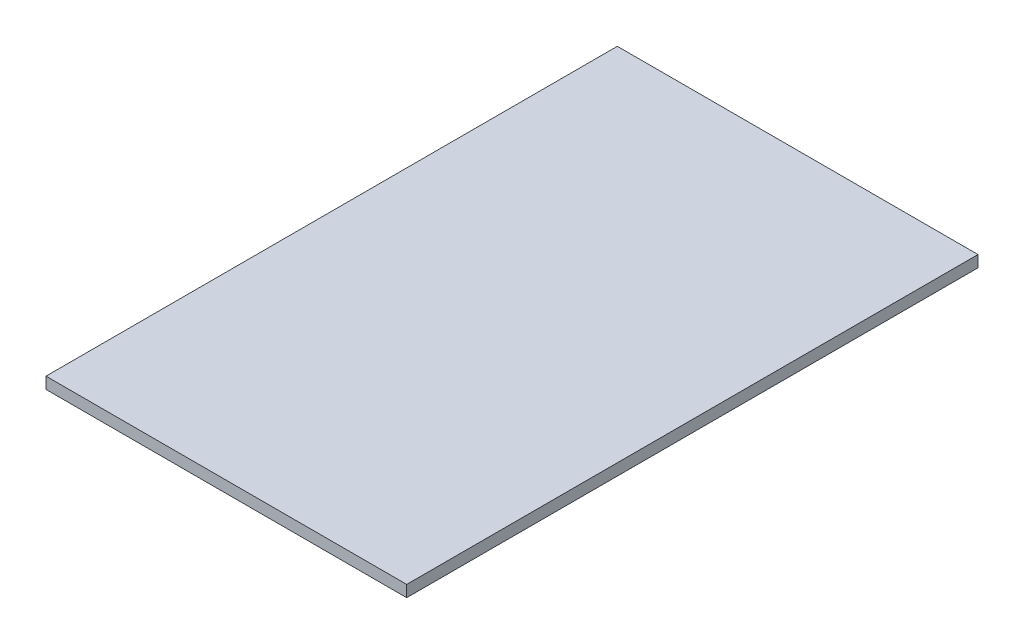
ISO-10303-21;
HEADER;
FILE_DESCRIPTION(('STEP AP214'),'2;1');
FILE_NAME('part.step','',(''),(''),'','','');
FILE_SCHEMA(('AUTOMOTIVE_DESIGN { 1 0 10303 214 1 1 1 1 }'));
ENDSEC;
DATA;
#1=APPLICATION_CONTEXT('core data for automotive mechanical design processes');
#2=APPLICATION_PROTOCOL_DEFINITION('international standard','automotive_design',2000,#1);
#3=PRODUCT_CONTEXT('',#1,'mechanical');
#4=PRODUCT('Part','Part','',(#3));
#5=PRODUCT_RELATED_PRODUCT_CATEGORY('part','',(#4));
#6=PRODUCT_DEFINITION_FORMATION('','',#4);
#7=PRODUCT_DEFINITION_CONTEXT('part definition',#1,'design');
#8=PRODUCT_DEFINITION('design','',#6,#7);
#9=PRODUCT_DEFINITION_SHAPE('','',#8);
#10=(LENGTH_UNIT() NAMED_UNIT(*) SI_UNIT(.MILLI.,.METRE.));
#11=(NAMED_UNIT(*) PLANE_ANGLE_UNIT() SI_UNIT($,.RADIAN.));
#12=(NAMED_UNIT(*) SI_UNIT($,.STERADIAN.) SOLID_ANGLE_UNIT());
#13=UNCERTAINTY_MEASURE_WITH_UNIT(LENGTH_MEASURE(1.E-05),#10,'distance_accuracy_value','');
#14=(GEOMETRIC_REPRESENTATION_CONTEXT(3) GLOBAL_UNCERTAINTY_ASSIGNED_CONTEXT((#13)) GLOBAL_UNIT_ASSIGNED_CONTEXT((#10,
#11,#12)) REPRESENTATION_CONTEXT('',''));
#15=CARTESIAN_POINT('',(0.,0.,0.));
#16=DIRECTION('',(0.,0.,1.));
#17=DIRECTION('',(1.,0.,0.));
#18=AXIS2_PLACEMENT_3D('',#15,#16,#17);
#19=CARTESIAN_POINT('',(250.,8.,0.));
#20=DIRECTION('',(0.,1.,0.));
#21=DIRECTION('',(0.,0.,1.));
#22=AXIS2_PLACEMENT_3D('',#19,#20,#21);
#23=PLANE('',#22);
#24=DIRECTION('',(0.,0.,1.));
#25=VECTOR('',#24,1.);
#26=CARTESIAN_POINT('',(0.,8.,0.));
#27=LINE('',#26,#25);
#28=CARTESIAN_POINT('',(0.,8.,396.));
#29=VERTEX_POINT('',#28);
#30=CARTESIAN_POINT('',(0.,8.,0.));
#31=VERTEX_POINT('',#30);
#32=EDGE_CURVE('E20',#29,#31,#27,.F.);
#33=ORIENTED_EDGE('',*,*,#32,.F.);
#34=DIRECTION('',(1.,0.,0.));
#35=VECTOR('',#34,1.);
#36=CARTESIAN_POINT('',(0.,8.,396.));
#37=LINE('',#36,#35);
#38=CARTESIAN_POINT('',(250.,8.,396.));
#39=VERTEX_POINT('',#38);
#40=EDGE_CURVE('E80',#39,#29,#37,.F.);
#41=ORIENTED_EDGE('',*,*,#40,.F.);
#42=DIRECTION('',(0.,0.,-1.));
#43=VECTOR('',#42,1.);
#44=CARTESIAN_POINT('',(250.,8.,0.));
#45=LINE('',#44,#43);
#46=CARTESIAN_POINT('',(250.,8.,0.));
#47=VERTEX_POINT('',#46);
#48=EDGE_CURVE('E61',#47,#39,#45,.F.);
#49=ORIENTED_EDGE('',*,*,#48,.F.);
#50=DIRECTION('',(1.,0.,0.));
#51=VECTOR('',#50,1.);
#52=CARTESIAN_POINT('',(0.,8.,0.));
#53=LINE('',#52,#51);
#54=EDGE_CURVE('E55',#47,#31,#53,.F.);
#55=ORIENTED_EDGE('',*,*,#54,.T.);
#56=EDGE_LOOP('',(#33,#41,#49,#55));
#57=FACE_BOUND('',#56,.T.);
#58=ADVANCED_FACE('F17',(#57),#23,.T.);
#59=CARTESIAN_POINT('',(0.,8.,0.));
#60=DIRECTION('',(-1.,0.,0.));
#61=DIRECTION('',(0.,0.,1.));
#62=AXIS2_PLACEMENT_3D('',#59,#60,#61);
#63=PLANE('',#62);
#64=DIRECTION('',(0.,0.,-1.));
#65=VECTOR('',#64,1.);
#66=CARTESIAN_POINT('',(0.,0.,0.));
#67=LINE('',#66,#65);
#68=CARTESIAN_POINT('',(0.,0.,396.));
#69=VERTEX_POINT('',#68);
#70=CARTESIAN_POINT('',(0.,0.,0.));
#71=VERTEX_POINT('',#70);
#72=EDGE_CURVE('E83',#69,#71,#67,.T.);
#73=ORIENTED_EDGE('',*,*,#72,.F.);
#74=DIRECTION('',(0.,1.,0.));
#75=VECTOR('',#74,1.);
#76=CARTESIAN_POINT('',(0.,0.,396.));
#77=LINE('',#76,#75);
#78=EDGE_CURVE('E68',#29,#69,#77,.F.);
#79=ORIENTED_EDGE('',*,*,#78,.F.);
#80=ORIENTED_EDGE('',*,*,#32,.T.);
#81=DIRECTION('',(0.,1.,0.));
#82=VECTOR('',#81,1.);
#83=CARTESIAN_POINT('',(0.,0.,0.));
#84=LINE('',#83,#82);
#85=EDGE_CURVE('E63',#31,#71,#84,.F.);
#86=ORIENTED_EDGE('',*,*,#85,.T.);
#87=EDGE_LOOP('',(#73,#79,#80,#86));
#88=FACE_BOUND('',#87,.T.);
#89=ADVANCED_FACE('F65',(#88),#63,.T.);
#90=CARTESIAN_POINT('',(0.,0.,0.));
#91=DIRECTION('',(0.,0.,1.));
#92=DIRECTION('',(1.,0.,0.));
#93=AXIS2_PLACEMENT_3D('',#90,#91,#92);
#94=PLANE('',#93);
#95=ORIENTED_EDGE('',*,*,#54,.F.);
#96=DIRECTION('',(0.,1.,0.));
#97=VECTOR('',#96,1.);
#98=CARTESIAN_POINT('',(250.,0.,0.));
#99=LINE('',#98,#97);
#100=CARTESIAN_POINT('',(250.,0.,0.));
#101=VERTEX_POINT('',#100);
#102=EDGE_CURVE('E74',#101,#47,#99,.T.);
#103=ORIENTED_EDGE('',*,*,#102,.F.);
#104=DIRECTION('',(1.,0.,0.));
#105=VECTOR('',#104,1.);
#106=CARTESIAN_POINT('',(0.,0.,0.));
#107=LINE('',#106,#105);
#108=EDGE_CURVE('E72',#71,#101,#107,.T.);
#109=ORIENTED_EDGE('',*,*,#108,.F.);
#110=ORIENTED_EDGE('',*,*,#85,.F.);
#111=EDGE_LOOP('',(#95,#103,#109,#110));
#112=FACE_BOUND('',#111,.T.);
#113=ADVANCED_FACE('F70',(#112),#94,.F.);
#114=CARTESIAN_POINT('',(250.,0.,0.));
#115=DIRECTION('',(1.,0.,0.));
#116=DIRECTION('',(0.,0.,-1.));
#117=AXIS2_PLACEMENT_3D('',#114,#115,#116);
#118=PLANE('',#117);
#119=ORIENTED_EDGE('',*,*,#48,.T.);
#120=DIRECTION('',(0.,1.,0.));
#121=VECTOR('',#120,1.);
#122=CARTESIAN_POINT('',(250.,0.,396.));
#123=LINE('',#122,#121);
#124=CARTESIAN_POINT('',(250.,0.,396.));
#125=VERTEX_POINT('',#124);
#126=EDGE_CURVE('E35',#125,#39,#123,.T.);
#127=ORIENTED_EDGE('',*,*,#126,.F.);
#128=DIRECTION('',(0.,0.,-1.));
#129=VECTOR('',#128,1.);
#130=CARTESIAN_POINT('',(250.,0.,0.));
#131=LINE('',#130,#129);
#132=EDGE_CURVE('E26',#101,#125,#131,.F.);
#133=ORIENTED_EDGE('',*,*,#132,.F.);
#134=ORIENTED_EDGE('',*,*,#102,.T.);
#135=EDGE_LOOP('',(#119,#127,#133,#134));
#136=FACE_BOUND('',#135,.T.);
#137=ADVANCED_FACE('F89',(#136),#118,.T.);
#138=CARTESIAN_POINT('',(0.,0.,396.));
#139=DIRECTION('',(0.,0.,1.));
#140=DIRECTION('',(1.,0.,0.));
#141=AXIS2_PLACEMENT_3D('',#138,#139,#140);
#142=PLANE('',#141);
#143=ORIENTED_EDGE('',*,*,#40,.T.);
#144=ORIENTED_EDGE('',*,*,#78,.T.);
#145=DIRECTION('',(1.,0.,0.));
#146=VECTOR('',#145,1.);
#147=CARTESIAN_POINT('',(0.,0.,396.));
#148=LINE('',#147,#146);
#149=EDGE_CURVE('E11',#125,#69,#148,.F.);
#150=ORIENTED_EDGE('',*,*,#149,.F.);
#151=ORIENTED_EDGE('',*,*,#126,.T.);
#152=EDGE_LOOP('',(#143,#144,#150,#151));
#153=FACE_BOUND('',#152,.T.);
#154=ADVANCED_FACE('F91',(#153),#142,.T.);
#155=CARTESIAN_POINT('',(0.,0.,0.));
#156=DIRECTION('',(0.,-1.,0.));
#157=DIRECTION('',(0.,0.,-1.));
#158=AXIS2_PLACEMENT_3D('',#155,#156,#157);
#159=PLANE('',#158);
#160=ORIENTED_EDGE('',*,*,#132,.T.);
#161=ORIENTED_EDGE('',*,*,#149,.T.);
#162=ORIENTED_EDGE('',*,*,#72,.T.);
#163=ORIENTED_EDGE('',*,*,#108,.T.);
#164=EDGE_LOOP('',(#160,#161,#162,#163));
#165=FACE_BOUND('',#164,.T.);
#166=ADVANCED_FACE('F88',(#165),#159,.T.);
#167=CLOSED_SHELL('',(#58,#89,#113,#137,#154,#166));
#168=MANIFOLD_SOLID_BREP('B1',#167);
#169=ADVANCED_BREP_SHAPE_REPRESENTATION('',(#18,#168),#14);
#170=SHAPE_DEFINITION_REPRESENTATION(#9,#169);
ENDSEC;
END-ISO-10303-21;
